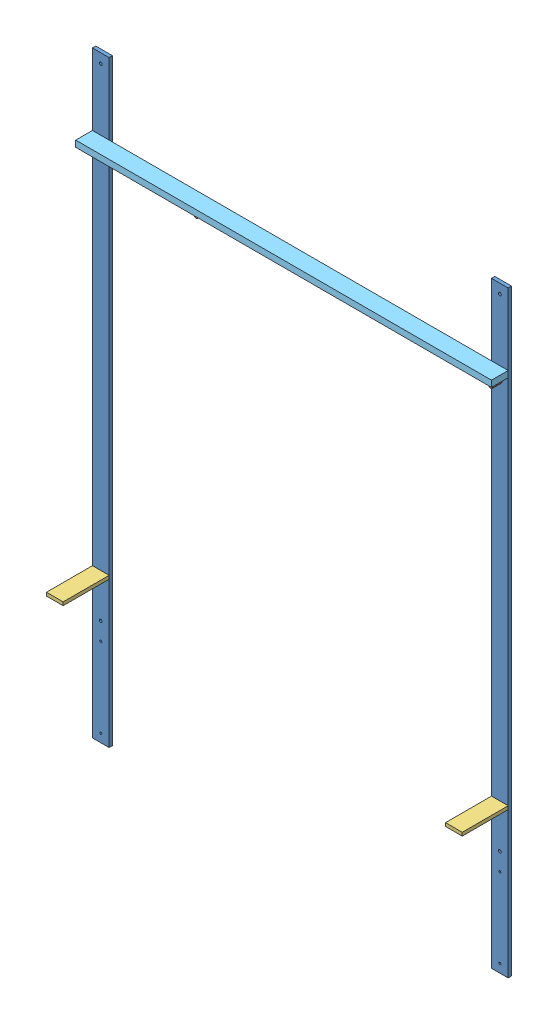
SolidWorks assembly BAE35194 (D).SLDASM, configuration Défaut (file format 3400). Lengths in mm.
Overall size (995 1430 118).
8 component instances, 5 part files, 13 mates.
Components (placement in the parent):
- BA035195-1: BA035195.SLDPRT [Défaut] at origin size (40 1430 8)
- 6004 (30)-2: 6004 (30).sldprt [Défaut] at (-685 1228 22) x (0.653057 -0.757308 0) z (0 0 -1) size (10 10 30)
- 1178 (110)-1: 1178 (110).SLDPRT [Défaut] at (0 357 110) x (0 0 -1) z (0 -1 0) size (110 40 8)
- 1178 (110)-2: 1178 (110).SLDPRT [Défaut] at (-955 357 110) x (0 0 -1) z (0 -1 0) size (110 40 8)
- BA035195-2: BA035195.SLDPRT [Défaut] at (-955 0 0) size (40 1430 8)
- BA033608-1: BA033608.SLDPRT [Défaut] at (0 1248 -8) x (0 -1 0) z (0 0 -1) size (40 915 8)
- 6004 (30)-3: 6004 (30).sldprt [Défaut] at (20 1228 -8) size (10 10 30)
- 1125 (995)-2: 1125 (995).sldprt [Défaut] at (40 1251.5 20) x (0 0 1) z (-1 0 0) size (40 15 995)
Mates (geometry in assembly coordinates):
- Coaxiale2: concentric aligned: cylinder of 6004 (30)-2; circle of BA033608-1
- Coïncidente7: coincident aligned: plane of 6004 (30)-2 through (-685 1228 -8) normal (0 0 -1); plane of BA033608-1 through (0 1208 -8) normal (0 0 -1)
- Coïncidente8: coincident anti-aligned: plane of BA035195-1 through (40 0 0) normal (0 0 1); plane of 1178 (110)-1 through (0 349 0) normal (0 0 -1)
- Coïncidente9: coincident aligned: plane of BA035195-1 through (40 1430 -8) normal (1 0 0); plane of 1178 (110)-1 through (40 349 110) normal (1 0 0)
- Distance5: distance = 349 mm aligned: plane of BA035195-1 through (40 0 -8) normal (0 -1 0); plane of 1178 (110)-1 through (40 349 110) normal (0 -1 0)
- Distance2: distance = 20 mm: axis of BA035195-1; plane of BA033608-1 through (-915 1248 0) normal (0 1 0)
- Coïncidente21: coincident anti-aligned: plane of BA035195-1 through (0 1430 -8) normal (-1 0 0); plane of BA033608-1 through (0 1208 0) normal (1 0 0)
- Coïncidente22: coincident aligned: plane of BA035195-1 through (40 0 0) normal (0 0 1); plane of BA033608-1 through (0 1208 0) normal (0 0 1)
- Coaxiale3: concentric aligned: circle of BA035195-1; cylinder of 6004 (30)-3
- Coïncidente23: coincident aligned: plane of BA035195-1 through (40 0 -8) normal (0 0 -1); plane of 6004 (30)-3 through (20 1228 -8) normal (0 0 -1)
- Coïncidente24: coincident anti-aligned: plane of BA035195-1 through (40 0 0) normal (0 0 1); plane of 1125 (995)-2 through (-955 1259 0) normal (0 0 -1)
- Coïncidente25: coincident aligned: plane of BA035195-1 through (40 1430 -8) normal (1 0 0); plane of 1125 (995)-2 through (40 1244 0) normal (1 0 0)
- Distance4: distance = 36 mm aligned: unknown of BA033608-1; unknown of 1125 (995)-2
